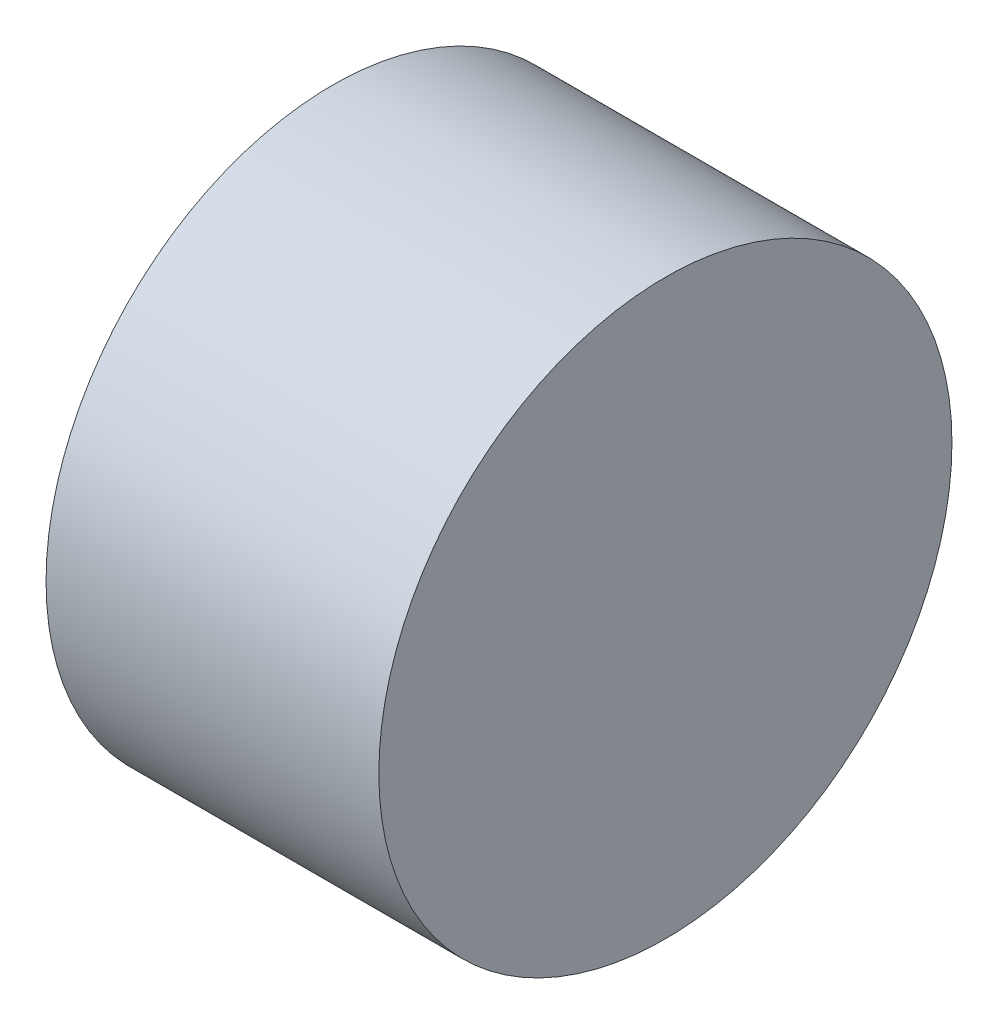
ISO-10303-21;
HEADER;
FILE_DESCRIPTION(('STEP AP214'),'2;1');
FILE_NAME('part.step','',(''),(''),'','','');
FILE_SCHEMA(('AUTOMOTIVE_DESIGN { 1 0 10303 214 1 1 1 1 }'));
ENDSEC;
DATA;
#1=APPLICATION_CONTEXT('core data for automotive mechanical design processes');
#2=APPLICATION_PROTOCOL_DEFINITION('international standard','automotive_design',2000,#1);
#3=PRODUCT_CONTEXT('',#1,'mechanical');
#4=PRODUCT('Part','Part','',(#3));
#5=PRODUCT_RELATED_PRODUCT_CATEGORY('part','',(#4));
#6=PRODUCT_DEFINITION_FORMATION('','',#4);
#7=PRODUCT_DEFINITION_CONTEXT('part definition',#1,'design');
#8=PRODUCT_DEFINITION('design','',#6,#7);
#9=PRODUCT_DEFINITION_SHAPE('','',#8);
#10=(LENGTH_UNIT() NAMED_UNIT(*) SI_UNIT(.MILLI.,.METRE.));
#11=(NAMED_UNIT(*) PLANE_ANGLE_UNIT() SI_UNIT($,.RADIAN.));
#12=(NAMED_UNIT(*) SI_UNIT($,.STERADIAN.) SOLID_ANGLE_UNIT());
#13=UNCERTAINTY_MEASURE_WITH_UNIT(LENGTH_MEASURE(1.E-05),#10,'distance_accuracy_value','');
#14=(GEOMETRIC_REPRESENTATION_CONTEXT(3) GLOBAL_UNCERTAINTY_ASSIGNED_CONTEXT((#13)) GLOBAL_UNIT_ASSIGNED_CONTEXT((#10,
#11,#12)) REPRESENTATION_CONTEXT('',''));
#15=CARTESIAN_POINT('',(0.,0.,0.));
#16=DIRECTION('',(0.,0.,1.));
#17=DIRECTION('',(1.,0.,0.));
#18=AXIS2_PLACEMENT_3D('',#15,#16,#17);
#19=CARTESIAN_POINT('',(0.507999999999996,0.,0.));
#20=DIRECTION('',(1.,0.,0.));
#21=DIRECTION('',(0.,0.,-1.));
#22=AXIS2_PLACEMENT_3D('',#19,#20,#21);
#23=PLANE('',#22);
#24=DIRECTION('',(0.,-0.499999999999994,-0.866025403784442));
#25=VECTOR('',#24,1.);
#26=CARTESIAN_POINT('',(0.50800000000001,-0.984250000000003,1.70477100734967));
#27=LINE('',#26,#25);
#28=CARTESIAN_POINT('',(0.508000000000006,-1.96849999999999,0.));
#29=VERTEX_POINT('',#28);
#30=CARTESIAN_POINT('',(0.508000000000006,-0.984250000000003,1.70477100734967));
#31=VERTEX_POINT('',#30);
#32=EDGE_CURVE('E77',#29,#31,#27,.F.);
#33=ORIENTED_EDGE('',*,*,#32,.T.);
#34=DIRECTION('',(0.,1.,0.));
#35=VECTOR('',#34,1.);
#36=CARTESIAN_POINT('',(0.50800000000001,0.984249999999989,1.70477100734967));
#37=LINE('',#36,#35);
#38=CARTESIAN_POINT('',(0.508000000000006,0.984249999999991,1.70477100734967));
#39=VERTEX_POINT('',#38);
#40=EDGE_CURVE('E92',#31,#39,#37,.T.);
#41=ORIENTED_EDGE('',*,*,#40,.T.);
#42=DIRECTION('',(0.,-0.500000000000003,0.866025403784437));
#43=VECTOR('',#42,1.);
#44=CARTESIAN_POINT('',(0.50800000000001,1.96850000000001,0.));
#45=LINE('',#44,#43);
#46=CARTESIAN_POINT('',(0.508000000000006,1.9685,0.));
#47=VERTEX_POINT('',#46);
#48=EDGE_CURVE('E97',#39,#47,#45,.F.);
#49=ORIENTED_EDGE('',*,*,#48,.T.);
#50=DIRECTION('',(0.,0.500000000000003,0.866025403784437));
#51=VECTOR('',#50,1.);
#52=CARTESIAN_POINT('',(0.50800000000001,0.984249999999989,-1.70477100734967));
#53=LINE('',#52,#51);
#54=CARTESIAN_POINT('',(0.508000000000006,0.984249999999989,-1.70477100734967));
#55=VERTEX_POINT('',#54);
#56=EDGE_CURVE('E100',#47,#55,#53,.F.);
#57=ORIENTED_EDGE('',*,*,#56,.T.);
#58=DIRECTION('',(0.,1.,0.));
#59=VECTOR('',#58,1.);
#60=CARTESIAN_POINT('',(0.50800000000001,-0.984250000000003,-1.70477100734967));
#61=LINE('',#60,#59);
#62=CARTESIAN_POINT('',(0.508000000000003,-0.984250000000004,-1.70477100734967));
#63=VERTEX_POINT('',#62);
#64=EDGE_CURVE('E62',#55,#63,#61,.F.);
#65=ORIENTED_EDGE('',*,*,#64,.T.);
#66=DIRECTION('',(0.,0.499999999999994,-0.866025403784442));
#67=VECTOR('',#66,1.);
#68=CARTESIAN_POINT('',(0.50800000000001,-1.96849999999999,0.));
#69=LINE('',#68,#67);
#70=EDGE_CURVE('E74',#63,#29,#69,.F.);
#71=ORIENTED_EDGE('',*,*,#70,.T.);
#72=EDGE_LOOP('',(#33,#41,#49,#57,#65,#71));
#73=FACE_BOUND('',#72,.T.);
#74=ADVANCED_FACE('F16',(#73),#23,.F.);
#75=CARTESIAN_POINT('',(0.50800000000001,-1.96849999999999,0.));
#76=DIRECTION('',(0.,-0.866025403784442,-0.499999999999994));
#77=DIRECTION('',(0.,0.499999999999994,-0.866025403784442));
#78=AXIS2_PLACEMENT_3D('',#75,#76,#77);
#79=PLANE('',#78);
#80=DIRECTION('',(1.,0.,0.));
#81=VECTOR('',#80,1.);
#82=CARTESIAN_POINT('',(0.50800000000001,-1.96849999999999,0.));
#83=LINE('',#82,#81);
#84=CARTESIAN_POINT('',(-2.286,-1.96849999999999,0.));
#85=VERTEX_POINT('',#84);
#86=EDGE_CURVE('E79',#85,#29,#83,.T.);
#87=ORIENTED_EDGE('',*,*,#86,.T.);
#88=ORIENTED_EDGE('',*,*,#70,.F.);
#89=DIRECTION('',(-1.,0.,0.));
#90=VECTOR('',#89,1.);
#91=CARTESIAN_POINT('',(0.50800000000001,-0.984250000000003,-1.70477100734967));
#92=LINE('',#91,#90);
#93=CARTESIAN_POINT('',(-2.286,-0.984250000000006,-1.70477100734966));
#94=VERTEX_POINT('',#93);
#95=EDGE_CURVE('E55',#63,#94,#92,.T.);
#96=ORIENTED_EDGE('',*,*,#95,.T.);
#97=DIRECTION('',(0.,0.499999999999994,-0.866025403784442));
#98=VECTOR('',#97,1.);
#99=CARTESIAN_POINT('',(-2.286,-1.96849999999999,0.));
#100=LINE('',#99,#98);
#101=EDGE_CURVE('E20',#94,#85,#100,.F.);
#102=ORIENTED_EDGE('',*,*,#101,.T.);
#103=EDGE_LOOP('',(#87,#88,#96,#102));
#104=FACE_BOUND('',#103,.T.);
#105=ADVANCED_FACE('F82',(#104),#79,.F.);
#106=CARTESIAN_POINT('',(0.50800000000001,-0.984250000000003,1.70477100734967));
#107=DIRECTION('',(0.,-0.866025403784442,0.499999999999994));
#108=DIRECTION('',(0.,-0.499999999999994,-0.866025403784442));
#109=AXIS2_PLACEMENT_3D('',#106,#107,#108);
#110=PLANE('',#109);
#111=DIRECTION('',(1.,0.,0.));
#112=VECTOR('',#111,1.);
#113=CARTESIAN_POINT('',(0.50800000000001,-0.984250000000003,1.70477100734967));
#114=LINE('',#113,#112);
#115=CARTESIAN_POINT('',(-2.286,-0.984250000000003,1.70477100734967));
#116=VERTEX_POINT('',#115);
#117=EDGE_CURVE('E89',#116,#31,#114,.T.);
#118=ORIENTED_EDGE('',*,*,#117,.T.);
#119=ORIENTED_EDGE('',*,*,#32,.F.);
#120=ORIENTED_EDGE('',*,*,#86,.F.);
#121=DIRECTION('',(0.,-0.499999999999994,-0.866025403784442));
#122=VECTOR('',#121,1.);
#123=CARTESIAN_POINT('',(-2.286,-0.984250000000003,1.70477100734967));
#124=LINE('',#123,#122);
#125=EDGE_CURVE('E112',#85,#116,#124,.F.);
#126=ORIENTED_EDGE('',*,*,#125,.T.);
#127=EDGE_LOOP('',(#118,#119,#120,#126));
#128=FACE_BOUND('',#127,.T.);
#129=ADVANCED_FACE('F87',(#128),#110,.F.);
#130=CARTESIAN_POINT('',(0.50800000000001,0.984249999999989,1.70477100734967));
#131=DIRECTION('',(0.,0.,1.));
#132=DIRECTION('',(1.,0.,0.));
#133=AXIS2_PLACEMENT_3D('',#130,#131,#132);
#134=PLANE('',#133);
#135=DIRECTION('',(1.,0.,0.));
#136=VECTOR('',#135,1.);
#137=CARTESIAN_POINT('',(0.50800000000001,0.984249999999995,1.70477100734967));
#138=LINE('',#137,#136);
#139=CARTESIAN_POINT('',(-2.286,0.984249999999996,1.70477100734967));
#140=VERTEX_POINT('',#139);
#141=EDGE_CURVE('E96',#140,#39,#138,.T.);
#142=ORIENTED_EDGE('',*,*,#141,.T.);
#143=ORIENTED_EDGE('',*,*,#40,.F.);
#144=ORIENTED_EDGE('',*,*,#117,.F.);
#145=DIRECTION('',(0.,1.,0.));
#146=VECTOR('',#145,1.);
#147=CARTESIAN_POINT('',(-2.286,0.,1.70477100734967));
#148=LINE('',#147,#146);
#149=EDGE_CURVE('E109',#116,#140,#148,.T.);
#150=ORIENTED_EDGE('',*,*,#149,.T.);
#151=EDGE_LOOP('',(#142,#143,#144,#150));
#152=FACE_BOUND('',#151,.T.);
#153=ADVANCED_FACE('F122',(#152),#134,.F.);
#154=CARTESIAN_POINT('',(0.50800000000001,1.96850000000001,0.));
#155=DIRECTION('',(0.,0.866025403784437,0.500000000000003));
#156=DIRECTION('',(0.,-0.500000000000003,0.866025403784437));
#157=AXIS2_PLACEMENT_3D('',#154,#155,#156);
#158=PLANE('',#157);
#159=DIRECTION('',(1.,0.,0.));
#160=VECTOR('',#159,1.);
#161=CARTESIAN_POINT('',(0.50800000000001,1.9685,0.));
#162=LINE('',#161,#160);
#163=CARTESIAN_POINT('',(-2.286,1.9685,0.));
#164=VERTEX_POINT('',#163);
#165=EDGE_CURVE('E99',#164,#47,#162,.T.);
#166=ORIENTED_EDGE('',*,*,#165,.T.);
#167=ORIENTED_EDGE('',*,*,#48,.F.);
#168=ORIENTED_EDGE('',*,*,#141,.F.);
#169=DIRECTION('',(0.,-0.500000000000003,0.866025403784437));
#170=VECTOR('',#169,1.);
#171=CARTESIAN_POINT('',(-2.286,1.96850000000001,0.));
#172=LINE('',#171,#170);
#173=EDGE_CURVE('E111',#140,#164,#172,.F.);
#174=ORIENTED_EDGE('',*,*,#173,.T.);
#175=EDGE_LOOP('',(#166,#167,#168,#174));
#176=FACE_BOUND('',#175,.T.);
#177=ADVANCED_FACE('F129',(#176),#158,.F.);
#178=CARTESIAN_POINT('',(0.50800000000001,0.984249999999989,-1.70477100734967));
#179=DIRECTION('',(0.,0.866025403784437,-0.500000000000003));
#180=DIRECTION('',(0.,0.500000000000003,0.866025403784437));
#181=AXIS2_PLACEMENT_3D('',#178,#179,#180);
#182=PLANE('',#181);
#183=DIRECTION('',(-1.,0.,0.));
#184=VECTOR('',#183,1.);
#185=CARTESIAN_POINT('',(0.50800000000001,0.984249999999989,-1.70477100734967));
#186=LINE('',#185,#184);
#187=CARTESIAN_POINT('',(-2.286,0.984249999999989,-1.70477100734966));
#188=VERTEX_POINT('',#187);
#189=EDGE_CURVE('E102',#188,#55,#186,.F.);
#190=ORIENTED_EDGE('',*,*,#189,.T.);
#191=ORIENTED_EDGE('',*,*,#56,.F.);
#192=ORIENTED_EDGE('',*,*,#165,.F.);
#193=DIRECTION('',(0.,0.500000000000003,0.866025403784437));
#194=VECTOR('',#193,1.);
#195=CARTESIAN_POINT('',(-2.286,0.984249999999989,-1.70477100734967));
#196=LINE('',#195,#194);
#197=EDGE_CURVE('E35',#164,#188,#196,.F.);
#198=ORIENTED_EDGE('',*,*,#197,.T.);
#199=EDGE_LOOP('',(#190,#191,#192,#198));
#200=FACE_BOUND('',#199,.T.);
#201=ADVANCED_FACE('F132',(#200),#182,.F.);
#202=CARTESIAN_POINT('',(0.50800000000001,-0.984250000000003,-1.70477100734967));
#203=DIRECTION('',(0.,0.,-1.));
#204=DIRECTION('',(-1.,0.,0.));
#205=AXIS2_PLACEMENT_3D('',#202,#203,#204);
#206=PLANE('',#205);
#207=ORIENTED_EDGE('',*,*,#95,.F.);
#208=ORIENTED_EDGE('',*,*,#64,.F.);
#209=ORIENTED_EDGE('',*,*,#189,.F.);
#210=DIRECTION('',(0.,-1.,0.));
#211=VECTOR('',#210,1.);
#212=CARTESIAN_POINT('',(-2.286,0.,-1.70477100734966));
#213=LINE('',#212,#211);
#214=EDGE_CURVE('E107',#188,#94,#213,.T.);
#215=ORIENTED_EDGE('',*,*,#214,.T.);
#216=EDGE_LOOP('',(#207,#208,#209,#215));
#217=FACE_BOUND('',#216,.T.);
#218=ADVANCED_FACE('F134',(#217),#206,.F.);
#219=CARTESIAN_POINT('',(2.286,-3.937,4.01574));
#220=DIRECTION('',(1.,0.,0.));
#221=DIRECTION('',(0.,0.,-1.));
#222=AXIS2_PLACEMENT_3D('',#219,#220,#221);
#223=PLANE('',#222);
#224=CARTESIAN_POINT('',(2.286,0.,0.));
#225=DIRECTION('',(-1.,0.,0.));
#226=DIRECTION('',(0.,0.,1.));
#227=AXIS2_PLACEMENT_3D('',#224,#225,#226);
#228=CIRCLE('',#227,3.937);
#229=CARTESIAN_POINT('',(2.286,0.,3.937));
#230=VERTEX_POINT('',#229);
#231=EDGE_CURVE('E26',#230,#230,#228,.T.);
#232=ORIENTED_EDGE('',*,*,#231,.F.);
#233=EDGE_LOOP('',(#232));
#234=FACE_BOUND('',#233,.T.);
#235=ADVANCED_FACE('F136',(#234),#223,.T.);
#236=CARTESIAN_POINT('',(-2.286,-3.937,4.01574));
#237=DIRECTION('',(1.,0.,0.));
#238=DIRECTION('',(0.,0.,-1.));
#239=AXIS2_PLACEMENT_3D('',#236,#237,#238);
#240=PLANE('',#239);
#241=ORIENTED_EDGE('',*,*,#197,.F.);
#242=ORIENTED_EDGE('',*,*,#173,.F.);
#243=ORIENTED_EDGE('',*,*,#149,.F.);
#244=ORIENTED_EDGE('',*,*,#125,.F.);
#245=ORIENTED_EDGE('',*,*,#101,.F.);
#246=ORIENTED_EDGE('',*,*,#214,.F.);
#247=EDGE_LOOP('',(#241,#242,#243,#244,#245,#246));
#248=FACE_BOUND('',#247,.T.);
#249=CARTESIAN_POINT('',(-2.286,0.,0.));
#250=DIRECTION('',(-1.,0.,0.));
#251=DIRECTION('',(0.,0.,1.));
#252=AXIS2_PLACEMENT_3D('',#249,#250,#251);
#253=CIRCLE('',#252,3.937);
#254=CARTESIAN_POINT('',(-2.286,0.,3.937));
#255=VERTEX_POINT('',#254);
#256=EDGE_CURVE('E11',#255,#255,#253,.F.);
#257=ORIENTED_EDGE('',*,*,#256,.F.);
#258=EDGE_LOOP('',(#257));
#259=FACE_BOUND('',#258,.T.);
#260=ADVANCED_FACE('F125',(#248,#259),#240,.F.);
#261=CARTESIAN_POINT('',(2.286,0.,0.));
#262=DIRECTION('',(-1.,0.,0.));
#263=DIRECTION('',(0.,0.,1.));
#264=AXIS2_PLACEMENT_3D('',#261,#262,#263);
#265=CYLINDRICAL_SURFACE('',#264,3.937);
#266=ORIENTED_EDGE('',*,*,#231,.T.);
#267=EDGE_LOOP('',(#266));
#268=FACE_BOUND('',#267,.T.);
#269=ORIENTED_EDGE('',*,*,#256,.T.);
#270=EDGE_LOOP('',(#269));
#271=FACE_BOUND('',#270,.T.);
#272=ADVANCED_FACE('F18',(#268,#271),#265,.T.);
#273=CLOSED_SHELL('',(#74,#105,#129,#153,#177,#201,#218,#235,#260,#272));
#274=MANIFOLD_SOLID_BREP('B1',#273);
#275=ADVANCED_BREP_SHAPE_REPRESENTATION('',(#18,#274),#14);
#276=SHAPE_DEFINITION_REPRESENTATION(#9,#275);
ENDSEC;
END-ISO-10303-21;
